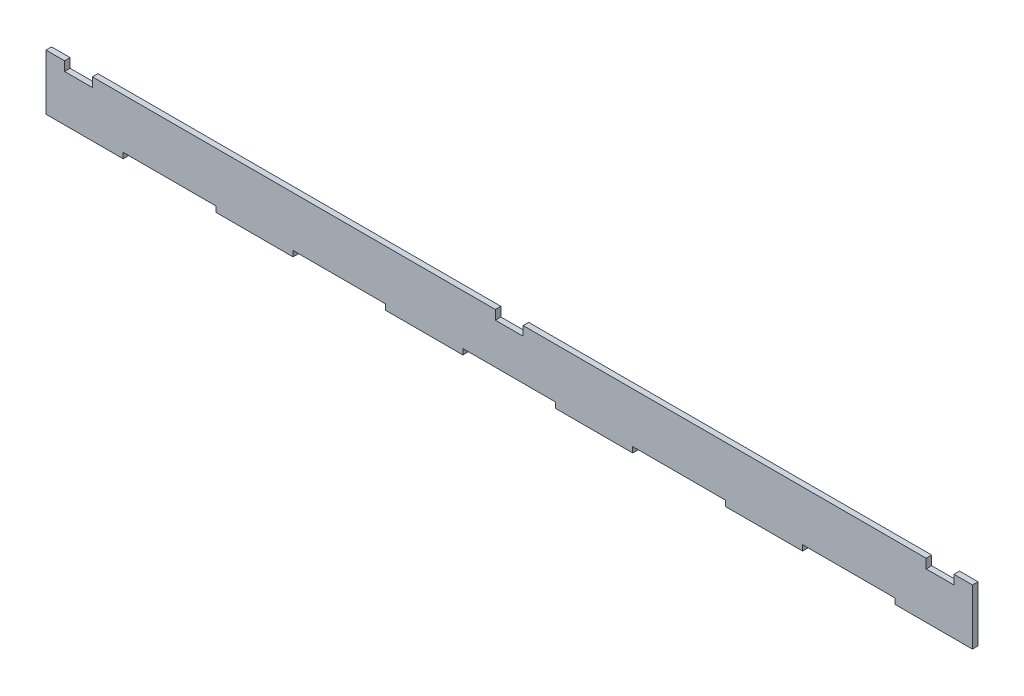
from build123d import *

# Parameters (mm, degrees)
SKIZZE1_W                       = 500
SKIZZE1_H                       = 30
AUFSATZ_LINEAR_AUSTRAGEN1_DEPTH = 3
SKIZZE2_W                       = 15
SKIZZE2_H                       = 5
SCHNITT_LINEAR_AUSTRAGEN1_DEPTH = 3
LINEARES_MUSTER1_COUNT          = 3
LINEARES_MUSTER1_PITCH          = 232.5
SKIZZE3_W                       = 50
SKIZZE3_H                       = 3
SCHNITT_LINEAR_AUSTRAGEN2_DEPTH = 3
LINEARES_MUSTER2_COUNT          = 5
LINEARES_MUSTER2_PITCH          = 91.666666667


with BuildPart() as part:
    # Skizze1 → Aufsatz-Linear austragen1 (new body)
    with BuildSketch(Plane.XY):
        with Locations((250, 15)):
            Rectangle(SKIZZE1_W, SKIZZE1_H)
    extrude(amount=AUFSATZ_LINEAR_AUSTRAGEN1_DEPTH)

    # Skizze2 → Schnitt-Linear austragen1 (cut)
    with BuildSketch(Plane.XY):
        with Locations((17.5, 27.5)):
            Rectangle(SKIZZE2_W, SKIZZE2_H)
    schnitt_linear_austragen1 = extrude(amount=SCHNITT_LINEAR_AUSTRAGEN1_DEPTH, mode=Mode.SUBTRACT)

    # Lineares Muster1: Schnitt-Linear austragen1 ×3
    with Locations(*[(i * LINEARES_MUSTER1_PITCH, 0, 0) for i in range(1, LINEARES_MUSTER1_COUNT)]):
        add(schnitt_linear_austragen1, mode=Mode.SUBTRACT)

    # Skizze3 → Schnitt-Linear austragen2 (cut)
    with BuildSketch(Plane.XY):
        with Locations((66.666666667, 1.5)):
            Rectangle(SKIZZE3_W, SKIZZE3_H)
    schnitt_linear_austragen2 = extrude(amount=SCHNITT_LINEAR_AUSTRAGEN2_DEPTH, mode=Mode.SUBTRACT)

    # Lineares Muster2: Schnitt-Linear austragen2 ×5
    with Locations(*[(i * LINEARES_MUSTER2_PITCH, 0, 0) for i in range(1, LINEARES_MUSTER2_COUNT)]):
        add(schnitt_linear_austragen2, mode=Mode.SUBTRACT)


solid = part.part
